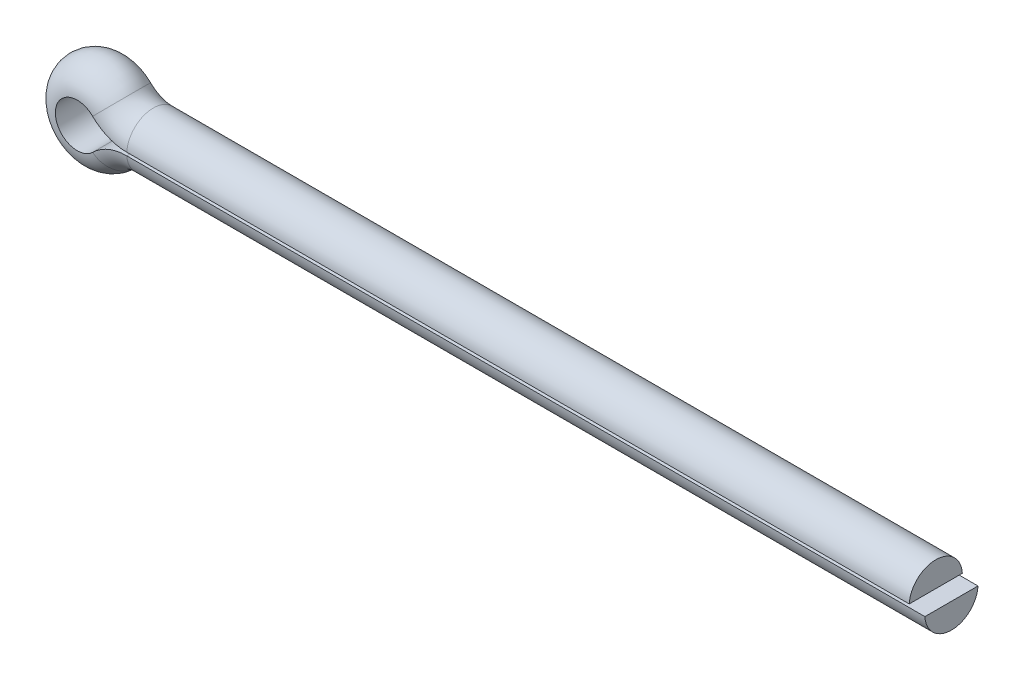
from build123d import *


with BuildPart() as part:
    # Sweep1: sweep along a path in PathSke
    with BuildLine(Plane.XY) as sweep1_path:
        Line((12.954, -0.4318), (0, -0.4318))
        ThreePointArc((0, -0.4318), (-0.144802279, -0.460389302), (-0.267873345, -0.541866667))
        ThreePointArc((-0.267873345, -0.541866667), (-1.565620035, 0), (-0.267873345, 0.541866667))
        ThreePointArc((-0.267873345, 0.541866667), (-0.144802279, 0.460389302), (0, 0.4318))
        Line((0, 0.4318), (12.7, 0.4318))
    # Sketch2 → Sweep1 (sweep)
    with BuildSketch(Plane(origin=(12.7, 0, 0), x_dir=(0, 0, -1), z_dir=(1, 0, 0))):
        with BuildLine():
            Line((-0.431052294, 0.0254), (0.431052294, 0.0254))
            ThreePointArc((0.431052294, 0.0254), (0, 0.4318), (-0.431052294, 0.0254))
        make_face()
    sweep(path=sweep1_path.line)


solid = part.part
